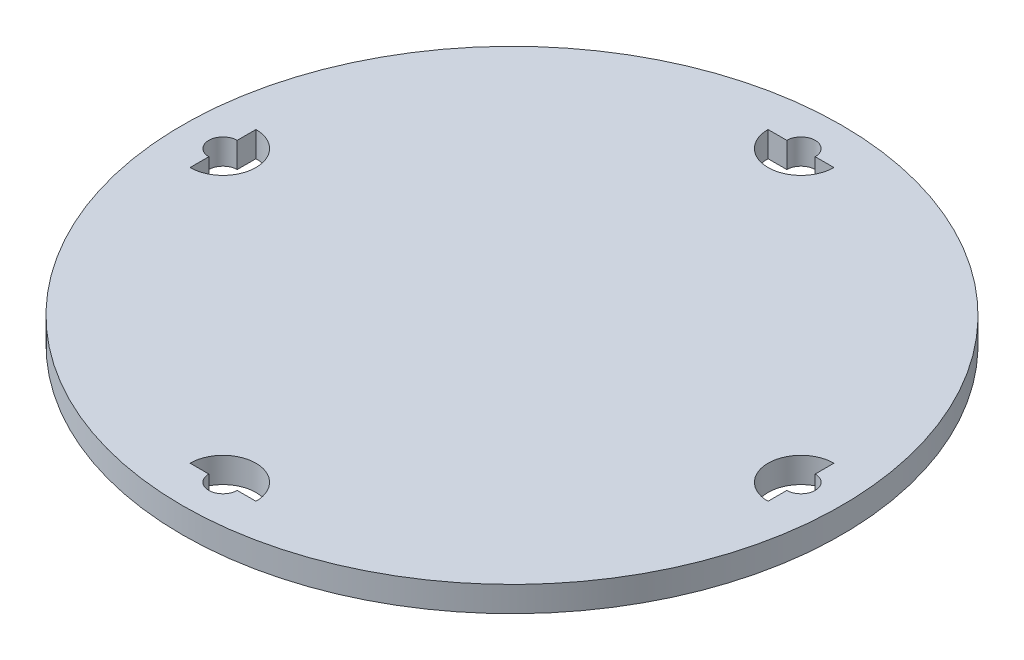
from build123d import *

# Parameters (mm, degrees)
SKETCH3_R           = 82.55
BOSS_EXTRUDE1_DEPTH = 6.35
CUT_EXTRUDE1_REACH  = 118.916
SKETCH4_R           = 3.556
CIRPATTERN1_COUNT   = 4


with BuildPart() as part:
    # Sketch3 → Boss-Extrude1 (new body)
    with BuildSketch(Plane(origin=(0, 0, 0), x_dir=(1, 0, 0), z_dir=(0, 1, 0))):
        with Locations(Location((0, 0, 0), (0, 0, 270))):
            Circle(SKETCH3_R)
    extrude(amount=BOSS_EXTRUDE1_DEPTH)

    # Sketch4 → Cut-Extrude1 (cut, up to next)
    with BuildSketch(Plane(origin=(0, 0, 0), x_dir=(1, 0, 0), z_dir=(0, 1, 0)), mode=Mode.PRIVATE) as cut_extrude1_sk1:
        with BuildLine():
            Line((-8.255, -72.39), (-3.556, -72.39))
            ThreePointArc((-3.556, -72.39), (0, -68.834), (3.556, -72.39))
            Line((3.556, -72.39), (8.255, -72.39))
            ThreePointArc((8.255, -72.39), (0, -64.135), (-8.255, -72.39))
        make_face()
    cut_extrude1_tool1 = extrude(cut_extrude1_sk1.sketch, amount=CUT_EXTRUDE1_REACH, mode=Mode.PRIVATE) & part.part
    # Sketch4 → Cut-Extrude1 (cut, up to next)
    with BuildSketch(Plane(origin=(0, 0, 0), x_dir=(1, 0, 0), z_dir=(0, 1, 0)), mode=Mode.PRIVATE) as cut_extrude1_sk2:
        with Locations((0, -72.39)):
            Circle(SKETCH4_R)
    cut_extrude1_tool2 = extrude(cut_extrude1_sk2.sketch, amount=CUT_EXTRUDE1_REACH, mode=Mode.PRIVATE) & part.part
    cut_extrude1_1 = cut_extrude1_tool1.solids().sort_by_distance((0, 0, 68.432082))[0]
    add(cut_extrude1_1, mode=Mode.SUBTRACT)
    cut_extrude1_2 = cut_extrude1_tool2.solids().sort_by_distance((0, 0, 72.39))[0]
    add(cut_extrude1_2, mode=Mode.SUBTRACT)
    cut_extrude1 = cut_extrude1_1 + cut_extrude1_2  # Cut-Extrude1 as one shape, for the pattern or mirror that repeats it

    # CirPattern1: Cut-Extrude1 ×4 about axis
    cirpattern1_axis = Axis((0, 0, 0), (0, 1, 0))
    for i in range(1, CIRPATTERN1_COUNT):
        add(cut_extrude1.rotate(cirpattern1_axis, i * 360 / CIRPATTERN1_COUNT), mode=Mode.SUBTRACT)


solid = part.part
